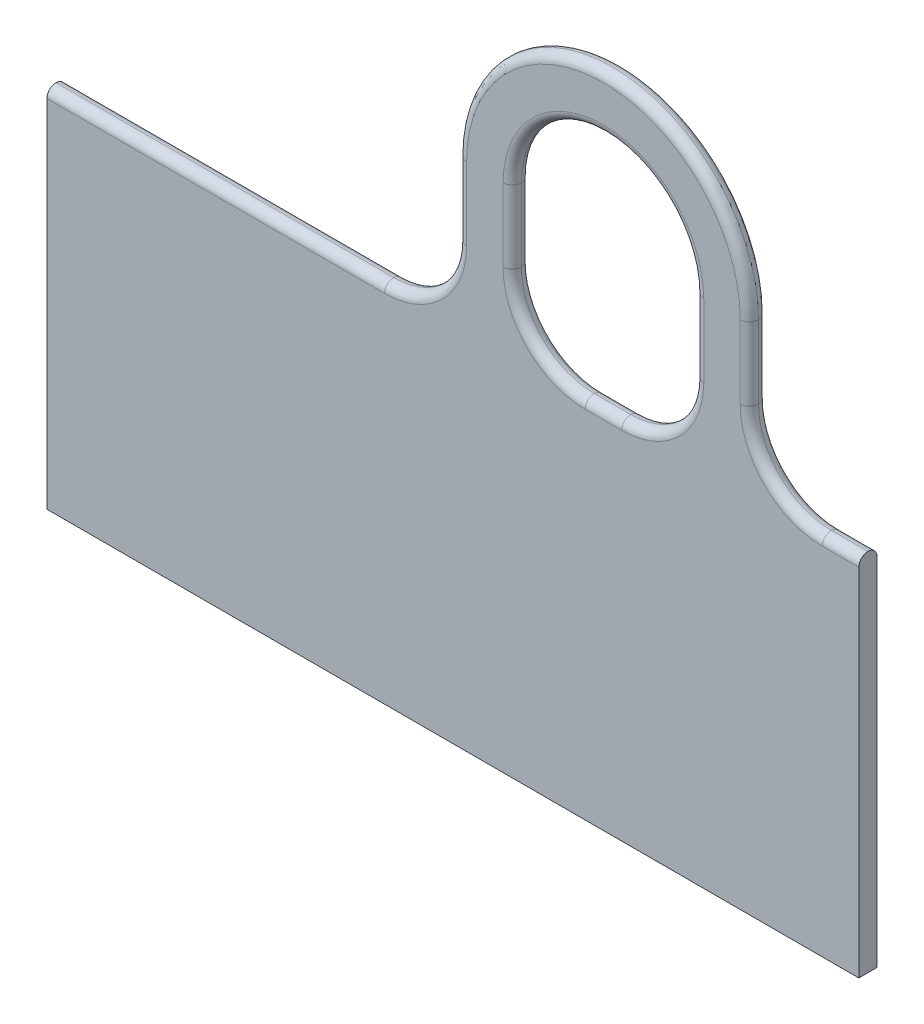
ISO-10303-21;
HEADER;
FILE_DESCRIPTION(('STEP AP214'),'2;1');
FILE_NAME('part.step','',(''),(''),'','','');
FILE_SCHEMA(('AUTOMOTIVE_DESIGN { 1 0 10303 214 1 1 1 1 }'));
ENDSEC;
DATA;
#1=APPLICATION_CONTEXT('core data for automotive mechanical design processes');
#2=APPLICATION_PROTOCOL_DEFINITION('international standard','automotive_design',2000,#1);
#3=PRODUCT_CONTEXT('',#1,'mechanical');
#4=PRODUCT('Part','Part','',(#3));
#5=PRODUCT_RELATED_PRODUCT_CATEGORY('part','',(#4));
#6=PRODUCT_DEFINITION_FORMATION('','',#4);
#7=PRODUCT_DEFINITION_CONTEXT('part definition',#1,'design');
#8=PRODUCT_DEFINITION('design','',#6,#7);
#9=PRODUCT_DEFINITION_SHAPE('','',#8);
#10=(LENGTH_UNIT() NAMED_UNIT(*) SI_UNIT(.MILLI.,.METRE.));
#11=(NAMED_UNIT(*) PLANE_ANGLE_UNIT() SI_UNIT($,.RADIAN.));
#12=(NAMED_UNIT(*) SI_UNIT($,.STERADIAN.) SOLID_ANGLE_UNIT());
#13=UNCERTAINTY_MEASURE_WITH_UNIT(LENGTH_MEASURE(1.E-05),#10,'distance_accuracy_value','');
#14=(GEOMETRIC_REPRESENTATION_CONTEXT(3) GLOBAL_UNCERTAINTY_ASSIGNED_CONTEXT((#13)) GLOBAL_UNIT_ASSIGNED_CONTEXT((#10,
#11,#12)) REPRESENTATION_CONTEXT('',''));
#15=CARTESIAN_POINT('',(0.,0.,0.));
#16=DIRECTION('',(0.,0.,1.));
#17=DIRECTION('',(1.,0.,0.));
#18=AXIS2_PLACEMENT_3D('',#15,#16,#17);
#19=CARTESIAN_POINT('',(-165.1,152.4,3.17499999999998));
#20=DIRECTION('',(0.,0.,-1.));
#21=DIRECTION('',(-1.,0.,0.));
#22=AXIS2_PLACEMENT_3D('',#19,#20,#21);
#23=PLANE('',#22);
#24=DIRECTION('',(0.,1.,0.));
#25=VECTOR('',#24,1.);
#26=CARTESIAN_POINT('',(2.22044604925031E-13,0.,3.17500000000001));
#27=LINE('',#26,#25);
#28=CARTESIAN_POINT('',(2.22044604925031E-13,0.,3.17500000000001));
#29=VERTEX_POINT('',#28);
#30=CARTESIAN_POINT('',(2.22044604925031E-13,123.825,3.17500000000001));
#31=VERTEX_POINT('',#30);
#32=EDGE_CURVE('E322',#29,#31,#27,.T.);
#33=ORIENTED_EDGE('',*,*,#32,.T.);
#34=DIRECTION('',(-1.,0.,0.));
#35=VECTOR('',#34,1.);
#36=CARTESIAN_POINT('',(-165.1,123.825,3.1749999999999));
#37=LINE('',#36,#35);
#38=CARTESIAN_POINT('',(-12.6999999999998,123.825,3.17500000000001));
#39=VERTEX_POINT('',#38);
#40=EDGE_CURVE('E11',#31,#39,#37,.T.);
#41=ORIENTED_EDGE('',*,*,#40,.T.);
#42=CARTESIAN_POINT('',(-12.6999999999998,152.4,3.1749999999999));
#43=DIRECTION('',(0.,0.,-1.));
#44=DIRECTION('',(-1.,0.,0.));
#45=AXIS2_PLACEMENT_3D('',#42,#43,#44);
#46=CIRCLE('',#45,28.575);
#47=CARTESIAN_POINT('',(-41.2749999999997,152.4,3.1749999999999));
#48=VERTEX_POINT('',#47);
#49=EDGE_CURVE('E47',#39,#48,#46,.T.);
#50=ORIENTED_EDGE('',*,*,#49,.T.);
#51=DIRECTION('',(0.,1.,0.));
#52=VECTOR('',#51,1.);
#53=CARTESIAN_POINT('',(-41.2749999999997,152.4,3.1749999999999));
#54=LINE('',#53,#52);
#55=CARTESIAN_POINT('',(-41.2749999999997,177.8,3.1749999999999));
#56=VERTEX_POINT('',#55);
#57=EDGE_CURVE('E381',#48,#56,#54,.T.);
#58=ORIENTED_EDGE('',*,*,#57,.T.);
#59=CARTESIAN_POINT('',(-88.8999999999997,177.8,3.1749999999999));
#60=DIRECTION('',(0.,0.,-1.));
#61=DIRECTION('',(-1.,0.,0.));
#62=AXIS2_PLACEMENT_3D('',#59,#60,#61);
#63=CIRCLE('',#62,47.625);
#64=CARTESIAN_POINT('',(-136.525,177.8,3.17499999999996));
#65=VERTEX_POINT('',#64);
#66=EDGE_CURVE('E379',#56,#65,#63,.F.);
#67=ORIENTED_EDGE('',*,*,#66,.T.);
#68=DIRECTION('',(0.,-1.,0.));
#69=VECTOR('',#68,1.);
#70=CARTESIAN_POINT('',(-136.525,152.4,3.17499999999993));
#71=LINE('',#70,#69);
#72=CARTESIAN_POINT('',(-136.525,152.4,3.17499999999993));
#73=VERTEX_POINT('',#72);
#74=EDGE_CURVE('E375',#65,#73,#71,.T.);
#75=ORIENTED_EDGE('',*,*,#74,.T.);
#76=CARTESIAN_POINT('',(-165.1,152.4,3.17499999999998));
#77=DIRECTION('',(0.,0.,-1.));
#78=DIRECTION('',(-1.,0.,0.));
#79=AXIS2_PLACEMENT_3D('',#76,#77,#78);
#80=CIRCLE('',#79,28.575);
#81=CARTESIAN_POINT('',(-165.1,123.825,3.1749999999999));
#82=VERTEX_POINT('',#81);
#83=EDGE_CURVE('E377',#73,#82,#80,.T.);
#84=ORIENTED_EDGE('',*,*,#83,.T.);
#85=DIRECTION('',(-1.,0.,0.));
#86=VECTOR('',#85,1.);
#87=CARTESIAN_POINT('',(-165.1,123.825,3.1749999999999));
#88=LINE('',#87,#86);
#89=CARTESIAN_POINT('',(-282.6004,123.825,3.17499999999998));
#90=VERTEX_POINT('',#89);
#91=EDGE_CURVE('E38',#82,#90,#88,.T.);
#92=ORIENTED_EDGE('',*,*,#91,.T.);
#93=DIRECTION('',(0.,-1.,0.));
#94=VECTOR('',#93,1.);
#95=CARTESIAN_POINT('',(-282.6004,0.,3.17499999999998));
#96=LINE('',#95,#94);
#97=CARTESIAN_POINT('',(-282.6004,0.,3.17499999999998));
#98=VERTEX_POINT('',#97);
#99=EDGE_CURVE('E318',#90,#98,#96,.T.);
#100=ORIENTED_EDGE('',*,*,#99,.T.);
#101=DIRECTION('',(1.,0.,0.));
#102=VECTOR('',#101,1.);
#103=CARTESIAN_POINT('',(-282.6004,0.,3.17499999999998));
#104=LINE('',#103,#102);
#105=EDGE_CURVE('E320',#98,#29,#104,.T.);
#106=ORIENTED_EDGE('',*,*,#105,.T.);
#107=EDGE_LOOP('',(#33,#41,#50,#58,#67,#75,#84,#92,#100,#106));
#108=FACE_BOUND('',#107,.T.);
#109=CARTESIAN_POINT('',(-82.5499999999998,152.4,3.1749999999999));
#110=DIRECTION('',(0.,0.,-1.));
#111=DIRECTION('',(-1.,0.,0.));
#112=AXIS2_PLACEMENT_3D('',#109,#110,#111);
#113=CIRCLE('',#112,28.575);
#114=CARTESIAN_POINT('',(-53.9749999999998,152.4,3.1749999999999));
#115=VERTEX_POINT('',#114);
#116=CARTESIAN_POINT('',(-82.5499999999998,123.825,3.1749999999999));
#117=VERTEX_POINT('',#116);
#118=EDGE_CURVE('E370',#115,#117,#113,.T.);
#119=ORIENTED_EDGE('',*,*,#118,.T.);
#120=DIRECTION('',(1.,0.,0.));
#121=VECTOR('',#120,1.);
#122=CARTESIAN_POINT('',(-95.2499999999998,123.825,3.1749999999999));
#123=LINE('',#122,#121);
#124=CARTESIAN_POINT('',(-95.2499999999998,123.825,3.1749999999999));
#125=VERTEX_POINT('',#124);
#126=EDGE_CURVE('E372',#117,#125,#123,.F.);
#127=ORIENTED_EDGE('',*,*,#126,.T.);
#128=CARTESIAN_POINT('',(-95.2499999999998,152.4,3.1749999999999));
#129=DIRECTION('',(0.,0.,-1.));
#130=DIRECTION('',(-1.,0.,0.));
#131=AXIS2_PLACEMENT_3D('',#128,#129,#130);
#132=CIRCLE('',#131,28.575);
#133=CARTESIAN_POINT('',(-123.825,152.4,3.1749999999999));
#134=VERTEX_POINT('',#133);
#135=EDGE_CURVE('E363',#125,#134,#132,.T.);
#136=ORIENTED_EDGE('',*,*,#135,.T.);
#137=DIRECTION('',(0.,-1.,0.));
#138=VECTOR('',#137,1.);
#139=CARTESIAN_POINT('',(-123.825,177.8,3.1749999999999));
#140=LINE('',#139,#138);
#141=CARTESIAN_POINT('',(-123.825,177.8,3.1749999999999));
#142=VERTEX_POINT('',#141);
#143=EDGE_CURVE('E189',#134,#142,#140,.F.);
#144=ORIENTED_EDGE('',*,*,#143,.T.);
#145=CARTESIAN_POINT('',(-88.8999999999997,177.8,3.1749999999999));
#146=DIRECTION('',(0.,0.,-1.));
#147=DIRECTION('',(-1.,0.,0.));
#148=AXIS2_PLACEMENT_3D('',#145,#146,#147);
#149=CIRCLE('',#148,34.925);
#150=CARTESIAN_POINT('',(-53.9749999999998,177.8,3.1749999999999));
#151=VERTEX_POINT('',#150);
#152=EDGE_CURVE('E366',#142,#151,#149,.T.);
#153=ORIENTED_EDGE('',*,*,#152,.T.);
#154=DIRECTION('',(0.,1.,0.));
#155=VECTOR('',#154,1.);
#156=CARTESIAN_POINT('',(-53.9749999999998,152.4,3.1749999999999));
#157=LINE('',#156,#155);
#158=EDGE_CURVE('E368',#151,#115,#157,.F.);
#159=ORIENTED_EDGE('',*,*,#158,.T.);
#160=EDGE_LOOP('',(#119,#127,#136,#144,#153,#159));
#161=FACE_BOUND('',#160,.T.);
#162=ADVANCED_FACE('F30',(#108,#161),#23,.F.);
#163=CARTESIAN_POINT('',(-282.6004,0.,3.17499999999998));
#164=DIRECTION('',(1.,0.,0.));
#165=DIRECTION('',(0.,0.,-1.));
#166=AXIS2_PLACEMENT_3D('',#163,#164,#165);
#167=PLANE('',#166);
#168=CARTESIAN_POINT('',(-282.6004,123.825,0.));
#169=DIRECTION('',(1.,0.,0.));
#170=DIRECTION('',(0.,0.,-1.));
#171=AXIS2_PLACEMENT_3D('',#168,#169,#170);
#172=CIRCLE('',#171,3.175);
#173=CARTESIAN_POINT('',(-282.6004,127.,0.));
#174=VERTEX_POINT('',#173);
#175=EDGE_CURVE('E359',#90,#174,#172,.F.);
#176=ORIENTED_EDGE('',*,*,#175,.T.);
#177=CARTESIAN_POINT('',(-282.6004,123.825,0.));
#178=DIRECTION('',(1.,0.,0.));
#179=DIRECTION('',(0.,0.,-1.));
#180=AXIS2_PLACEMENT_3D('',#177,#178,#179);
#181=CIRCLE('',#180,3.175);
#182=CARTESIAN_POINT('',(-282.6004,123.825,-3.17500000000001));
#183=VERTEX_POINT('',#182);
#184=EDGE_CURVE('E361',#174,#183,#181,.F.);
#185=ORIENTED_EDGE('',*,*,#184,.T.);
#186=DIRECTION('',(0.,-1.,0.));
#187=VECTOR('',#186,1.);
#188=CARTESIAN_POINT('',(-282.6004,0.,-3.17500000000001));
#189=LINE('',#188,#187);
#190=CARTESIAN_POINT('',(-282.6004,0.,-3.17500000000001));
#191=VERTEX_POINT('',#190);
#192=EDGE_CURVE('E310',#183,#191,#189,.T.);
#193=ORIENTED_EDGE('',*,*,#192,.T.);
#194=DIRECTION('',(0.,0.,-1.));
#195=VECTOR('',#194,1.);
#196=CARTESIAN_POINT('',(-282.6004,0.,3.17499999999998));
#197=LINE('',#196,#195);
#198=EDGE_CURVE('E326',#98,#191,#197,.T.);
#199=ORIENTED_EDGE('',*,*,#198,.F.);
#200=ORIENTED_EDGE('',*,*,#99,.F.);
#201=EDGE_LOOP('',(#176,#185,#193,#199,#200));
#202=FACE_BOUND('',#201,.T.);
#203=ADVANCED_FACE('F32',(#202),#167,.F.);
#204=CARTESIAN_POINT('',(-282.6004,0.,3.17499999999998));
#205=DIRECTION('',(0.,1.,0.));
#206=DIRECTION('',(0.,0.,1.));
#207=AXIS2_PLACEMENT_3D('',#204,#205,#206);
#208=PLANE('',#207);
#209=ORIENTED_EDGE('',*,*,#198,.T.);
#210=DIRECTION('',(1.,0.,0.));
#211=VECTOR('',#210,1.);
#212=CARTESIAN_POINT('',(-282.6004,0.,-3.17500000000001));
#213=LINE('',#212,#211);
#214=CARTESIAN_POINT('',(2.22044604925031E-13,0.,-3.17500000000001));
#215=VERTEX_POINT('',#214);
#216=EDGE_CURVE('E312',#191,#215,#213,.T.);
#217=ORIENTED_EDGE('',*,*,#216,.T.);
#218=DIRECTION('',(0.,0.,-1.));
#219=VECTOR('',#218,1.);
#220=CARTESIAN_POINT('',(2.22044604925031E-13,0.,3.17500000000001));
#221=LINE('',#220,#219);
#222=EDGE_CURVE('E324',#29,#215,#221,.T.);
#223=ORIENTED_EDGE('',*,*,#222,.F.);
#224=ORIENTED_EDGE('',*,*,#105,.F.);
#225=EDGE_LOOP('',(#209,#217,#223,#224));
#226=FACE_BOUND('',#225,.T.);
#227=ADVANCED_FACE('F407',(#226),#208,.F.);
#228=CARTESIAN_POINT('',(2.22044604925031E-13,0.,3.17500000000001));
#229=DIRECTION('',(-1.,0.,0.));
#230=DIRECTION('',(0.,0.,1.));
#231=AXIS2_PLACEMENT_3D('',#228,#229,#230);
#232=PLANE('',#231);
#233=DIRECTION('',(0.,1.,0.));
#234=VECTOR('',#233,1.);
#235=CARTESIAN_POINT('',(2.22044604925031E-13,0.,-3.17500000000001));
#236=LINE('',#235,#234);
#237=CARTESIAN_POINT('',(2.22044604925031E-13,123.825,-3.17500000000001));
#238=VERTEX_POINT('',#237);
#239=EDGE_CURVE('E315',#215,#238,#236,.T.);
#240=ORIENTED_EDGE('',*,*,#239,.T.);
#241=CARTESIAN_POINT('',(2.22044604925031E-13,123.825,0.));
#242=DIRECTION('',(-1.,0.,0.));
#243=DIRECTION('',(0.,0.,1.));
#244=AXIS2_PLACEMENT_3D('',#241,#242,#243);
#245=CIRCLE('',#244,3.175);
#246=CARTESIAN_POINT('',(2.22044604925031E-13,127.,0.));
#247=VERTEX_POINT('',#246);
#248=EDGE_CURVE('E357',#238,#247,#245,.F.);
#249=ORIENTED_EDGE('',*,*,#248,.T.);
#250=CARTESIAN_POINT('',(2.22044604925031E-13,123.825,0.));
#251=DIRECTION('',(-1.,0.,0.));
#252=DIRECTION('',(0.,0.,1.));
#253=AXIS2_PLACEMENT_3D('',#250,#251,#252);
#254=CIRCLE('',#253,3.175);
#255=EDGE_CURVE('E355',#247,#31,#254,.F.);
#256=ORIENTED_EDGE('',*,*,#255,.T.);
#257=ORIENTED_EDGE('',*,*,#32,.F.);
#258=ORIENTED_EDGE('',*,*,#222,.T.);
#259=EDGE_LOOP('',(#240,#249,#256,#257,#258));
#260=FACE_BOUND('',#259,.T.);
#261=ADVANCED_FACE('F463',(#260),#232,.F.);
#262=CARTESIAN_POINT('',(-165.1,152.4,-3.17500000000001));
#263=DIRECTION('',(0.,0.,-1.));
#264=DIRECTION('',(-1.,0.,0.));
#265=AXIS2_PLACEMENT_3D('',#262,#263,#264);
#266=PLANE('',#265);
#267=DIRECTION('',(0.,-1.,0.));
#268=VECTOR('',#267,1.);
#269=CARTESIAN_POINT('',(-123.825,152.4,-3.17500000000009));
#270=LINE('',#269,#268);
#271=CARTESIAN_POINT('',(-123.825,177.8,-3.17500000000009));
#272=VERTEX_POINT('',#271);
#273=CARTESIAN_POINT('',(-123.825,152.4,-3.17500000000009));
#274=VERTEX_POINT('',#273);
#275=EDGE_CURVE('E344',#272,#274,#270,.T.);
#276=ORIENTED_EDGE('',*,*,#275,.T.);
#277=CARTESIAN_POINT('',(-95.2499999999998,152.4,-3.17500000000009));
#278=DIRECTION('',(0.,0.,-1.));
#279=DIRECTION('',(-1.,0.,0.));
#280=AXIS2_PLACEMENT_3D('',#277,#278,#279);
#281=CIRCLE('',#280,28.575);
#282=CARTESIAN_POINT('',(-95.2499999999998,123.825,-3.17500000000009));
#283=VERTEX_POINT('',#282);
#284=EDGE_CURVE('E215',#274,#283,#281,.F.);
#285=ORIENTED_EDGE('',*,*,#284,.T.);
#286=DIRECTION('',(1.,0.,0.));
#287=VECTOR('',#286,1.);
#288=CARTESIAN_POINT('',(-165.1,123.825,-3.17500000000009));
#289=LINE('',#288,#287);
#290=CARTESIAN_POINT('',(-82.5499999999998,123.825,-3.17500000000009));
#291=VERTEX_POINT('',#290);
#292=EDGE_CURVE('E352',#283,#291,#289,.T.);
#293=ORIENTED_EDGE('',*,*,#292,.T.);
#294=CARTESIAN_POINT('',(-82.5499999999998,152.4,-3.17500000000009));
#295=DIRECTION('',(0.,0.,-1.));
#296=DIRECTION('',(-1.,0.,0.));
#297=AXIS2_PLACEMENT_3D('',#294,#295,#296);
#298=CIRCLE('',#297,28.575);
#299=CARTESIAN_POINT('',(-53.9749999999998,152.4,-3.17500000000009));
#300=VERTEX_POINT('',#299);
#301=EDGE_CURVE('E350',#291,#300,#298,.F.);
#302=ORIENTED_EDGE('',*,*,#301,.T.);
#303=DIRECTION('',(0.,1.,0.));
#304=VECTOR('',#303,1.);
#305=CARTESIAN_POINT('',(-53.9749999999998,152.4,-3.17500000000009));
#306=LINE('',#305,#304);
#307=CARTESIAN_POINT('',(-53.9749999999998,177.8,-3.17500000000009));
#308=VERTEX_POINT('',#307);
#309=EDGE_CURVE('E348',#300,#308,#306,.T.);
#310=ORIENTED_EDGE('',*,*,#309,.T.);
#311=CARTESIAN_POINT('',(-88.8999999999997,177.8,-3.17500000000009));
#312=DIRECTION('',(0.,0.,-1.));
#313=DIRECTION('',(-1.,0.,0.));
#314=AXIS2_PLACEMENT_3D('',#311,#312,#313);
#315=CIRCLE('',#314,34.925);
#316=EDGE_CURVE('E346',#308,#272,#315,.F.);
#317=ORIENTED_EDGE('',*,*,#316,.T.);
#318=EDGE_LOOP('',(#276,#285,#293,#302,#310,#317));
#319=FACE_BOUND('',#318,.T.);
#320=CARTESIAN_POINT('',(-12.6999999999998,152.4,-3.17500000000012));
#321=DIRECTION('',(0.,0.,-1.));
#322=DIRECTION('',(-1.,0.,0.));
#323=AXIS2_PLACEMENT_3D('',#320,#321,#322);
#324=CIRCLE('',#323,28.575);
#325=CARTESIAN_POINT('',(-41.2749999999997,152.4,-3.17500000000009));
#326=VERTEX_POINT('',#325);
#327=CARTESIAN_POINT('',(-12.6999999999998,123.825,-3.17500000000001));
#328=VERTEX_POINT('',#327);
#329=EDGE_CURVE('E329',#326,#328,#324,.F.);
#330=ORIENTED_EDGE('',*,*,#329,.T.);
#331=DIRECTION('',(-1.,0.,0.));
#332=VECTOR('',#331,1.);
#333=CARTESIAN_POINT('',(2.22044604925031E-13,123.825,-3.17500000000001));
#334=LINE('',#333,#332);
#335=EDGE_CURVE('E341',#328,#238,#334,.F.);
#336=ORIENTED_EDGE('',*,*,#335,.T.);
#337=ORIENTED_EDGE('',*,*,#239,.F.);
#338=ORIENTED_EDGE('',*,*,#216,.F.);
#339=ORIENTED_EDGE('',*,*,#192,.F.);
#340=DIRECTION('',(-1.,0.,0.));
#341=VECTOR('',#340,1.);
#342=CARTESIAN_POINT('',(-165.1,123.825,-3.17500000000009));
#343=LINE('',#342,#341);
#344=CARTESIAN_POINT('',(-165.1,123.825,-3.17500000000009));
#345=VERTEX_POINT('',#344);
#346=EDGE_CURVE('E339',#183,#345,#343,.F.);
#347=ORIENTED_EDGE('',*,*,#346,.T.);
#348=CARTESIAN_POINT('',(-165.1,152.4,-3.17500000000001));
#349=DIRECTION('',(0.,0.,-1.));
#350=DIRECTION('',(-1.,0.,0.));
#351=AXIS2_PLACEMENT_3D('',#348,#349,#350);
#352=CIRCLE('',#351,28.575);
#353=CARTESIAN_POINT('',(-136.525,152.4,-3.17500000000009));
#354=VERTEX_POINT('',#353);
#355=EDGE_CURVE('E337',#345,#354,#352,.F.);
#356=ORIENTED_EDGE('',*,*,#355,.T.);
#357=DIRECTION('',(0.,-1.,0.));
#358=VECTOR('',#357,1.);
#359=CARTESIAN_POINT('',(-136.525,177.8,-3.17500000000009));
#360=LINE('',#359,#358);
#361=CARTESIAN_POINT('',(-136.525,177.8,-3.17500000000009));
#362=VERTEX_POINT('',#361);
#363=EDGE_CURVE('E335',#354,#362,#360,.F.);
#364=ORIENTED_EDGE('',*,*,#363,.T.);
#365=CARTESIAN_POINT('',(-88.8999999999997,177.8,-3.17500000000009));
#366=DIRECTION('',(0.,0.,-1.));
#367=DIRECTION('',(-1.,0.,0.));
#368=AXIS2_PLACEMENT_3D('',#365,#366,#367);
#369=CIRCLE('',#368,47.625);
#370=CARTESIAN_POINT('',(-41.2749999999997,177.8,-3.17500000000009));
#371=VERTEX_POINT('',#370);
#372=EDGE_CURVE('E333',#362,#371,#369,.T.);
#373=ORIENTED_EDGE('',*,*,#372,.T.);
#374=DIRECTION('',(0.,1.,0.));
#375=VECTOR('',#374,1.);
#376=CARTESIAN_POINT('',(-41.2749999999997,152.4,-3.17500000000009));
#377=LINE('',#376,#375);
#378=EDGE_CURVE('E331',#371,#326,#377,.F.);
#379=ORIENTED_EDGE('',*,*,#378,.T.);
#380=EDGE_LOOP('',(#330,#336,#337,#338,#339,#347,#356,#364,#373,#379));
#381=FACE_BOUND('',#380,.T.);
#382=ADVANCED_FACE('F403',(#319,#381),#266,.T.);
#383=CARTESIAN_POINT('',(-165.1,123.825,-1.11022302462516E-13));
#384=DIRECTION('',(-1.,0.,0.));
#385=DIRECTION('',(0.,0.,1.));
#386=AXIS2_PLACEMENT_3D('',#383,#384,#385);
#387=CYLINDRICAL_SURFACE('',#386,3.175);
#388=ORIENTED_EDGE('',*,*,#175,.F.);
#389=ORIENTED_EDGE('',*,*,#91,.F.);
#390=CARTESIAN_POINT('',(-165.1,123.825,-1.11022302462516E-13));
#391=DIRECTION('',(1.,0.,0.));
#392=DIRECTION('',(0.,0.,-1.));
#393=AXIS2_PLACEMENT_3D('',#390,#391,#392);
#394=CIRCLE('',#393,3.175);
#395=CARTESIAN_POINT('',(-165.1,127.,0.));
#396=VERTEX_POINT('',#395);
#397=EDGE_CURVE('E307',#396,#82,#394,.T.);
#398=ORIENTED_EDGE('',*,*,#397,.F.);
#399=DIRECTION('',(-1.,0.,0.));
#400=VECTOR('',#399,1.);
#401=CARTESIAN_POINT('',(-282.6004,127.,0.));
#402=LINE('',#401,#400);
#403=EDGE_CURVE('E304',#174,#396,#402,.F.);
#404=ORIENTED_EDGE('',*,*,#403,.F.);
#405=EDGE_LOOP('',(#388,#389,#398,#404));
#406=FACE_BOUND('',#405,.T.);
#407=ADVANCED_FACE('F393',(#406),#387,.T.);
#408=CARTESIAN_POINT('',(-165.1,152.4,0.));
#409=DIRECTION('',(0.,0.,-1.));
#410=DIRECTION('',(-1.,0.,0.));
#411=AXIS2_PLACEMENT_3D('',#408,#409,#410);
#412=TOROIDAL_SURFACE('',#411,28.575,3.175);
#413=ORIENTED_EDGE('',*,*,#397,.T.);
#414=ORIENTED_EDGE('',*,*,#83,.F.);
#415=CARTESIAN_POINT('',(-136.525,152.4,-1.11022302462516E-13));
#416=DIRECTION('',(0.,1.,0.));
#417=DIRECTION('',(0.,0.,1.));
#418=AXIS2_PLACEMENT_3D('',#415,#416,#417);
#419=CIRCLE('',#418,3.175);
#420=CARTESIAN_POINT('',(-139.7,152.4,-1.11022302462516E-13));
#421=VERTEX_POINT('',#420);
#422=EDGE_CURVE('E301',#421,#73,#419,.T.);
#423=ORIENTED_EDGE('',*,*,#422,.F.);
#424=CARTESIAN_POINT('',(-165.1,152.4,0.));
#425=DIRECTION('',(0.,0.,-1.));
#426=DIRECTION('',(-1.,0.,0.));
#427=AXIS2_PLACEMENT_3D('',#424,#425,#426);
#428=CIRCLE('',#427,25.4);
#429=EDGE_CURVE('E298',#396,#421,#428,.F.);
#430=ORIENTED_EDGE('',*,*,#429,.F.);
#431=EDGE_LOOP('',(#413,#414,#423,#430));
#432=FACE_BOUND('',#431,.T.);
#433=ADVANCED_FACE('F447',(#432),#412,.T.);
#434=CARTESIAN_POINT('',(-282.6004,123.825,0.));
#435=DIRECTION('',(1.,0.,0.));
#436=DIRECTION('',(0.,0.,-1.));
#437=AXIS2_PLACEMENT_3D('',#434,#435,#436);
#438=CYLINDRICAL_SURFACE('',#437,3.175);
#439=ORIENTED_EDGE('',*,*,#184,.F.);
#440=ORIENTED_EDGE('',*,*,#403,.T.);
#441=CARTESIAN_POINT('',(-165.1,123.825,-1.11022302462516E-13));
#442=DIRECTION('',(1.,0.,0.));
#443=DIRECTION('',(0.,0.,-1.));
#444=AXIS2_PLACEMENT_3D('',#441,#442,#443);
#445=CIRCLE('',#444,3.175);
#446=EDGE_CURVE('E295',#345,#396,#445,.T.);
#447=ORIENTED_EDGE('',*,*,#446,.F.);
#448=ORIENTED_EDGE('',*,*,#346,.F.);
#449=EDGE_LOOP('',(#439,#440,#447,#448));
#450=FACE_BOUND('',#449,.T.);
#451=ADVANCED_FACE('F399',(#450),#438,.T.);
#452=CARTESIAN_POINT('',(-136.525,152.4,-1.11022302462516E-13));
#453=DIRECTION('',(0.,-1.,0.));
#454=DIRECTION('',(0.,0.,-1.));
#455=AXIS2_PLACEMENT_3D('',#452,#453,#454);
#456=CYLINDRICAL_SURFACE('',#455,3.175);
#457=ORIENTED_EDGE('',*,*,#422,.T.);
#458=ORIENTED_EDGE('',*,*,#74,.F.);
#459=CARTESIAN_POINT('',(-136.525,177.8,-1.11022302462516E-13));
#460=DIRECTION('',(0.,1.,0.));
#461=DIRECTION('',(0.,0.,1.));
#462=AXIS2_PLACEMENT_3D('',#459,#460,#461);
#463=CIRCLE('',#462,3.175);
#464=CARTESIAN_POINT('',(-139.7,177.8,-1.11022302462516E-13));
#465=VERTEX_POINT('',#464);
#466=EDGE_CURVE('E292',#465,#65,#463,.T.);
#467=ORIENTED_EDGE('',*,*,#466,.F.);
#468=DIRECTION('',(0.,-1.,0.));
#469=VECTOR('',#468,1.);
#470=CARTESIAN_POINT('',(-139.7,177.8,-1.11022302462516E-13));
#471=LINE('',#470,#469);
#472=EDGE_CURVE('E289',#421,#465,#471,.F.);
#473=ORIENTED_EDGE('',*,*,#472,.F.);
#474=EDGE_LOOP('',(#457,#458,#467,#473));
#475=FACE_BOUND('',#474,.T.);
#476=ADVANCED_FACE('F436',(#475),#456,.T.);
#477=CARTESIAN_POINT('',(-165.1,152.4,0.));
#478=DIRECTION('',(0.,0.,-1.));
#479=DIRECTION('',(-1.,0.,0.));
#480=AXIS2_PLACEMENT_3D('',#477,#478,#479);
#481=TOROIDAL_SURFACE('',#480,28.575,3.175);
#482=ORIENTED_EDGE('',*,*,#446,.T.);
#483=ORIENTED_EDGE('',*,*,#429,.T.);
#484=CARTESIAN_POINT('',(-136.525,152.4,-1.11022302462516E-13));
#485=DIRECTION('',(0.,1.,0.));
#486=DIRECTION('',(0.,0.,1.));
#487=AXIS2_PLACEMENT_3D('',#484,#485,#486);
#488=CIRCLE('',#487,3.175);
#489=EDGE_CURVE('E286',#354,#421,#488,.T.);
#490=ORIENTED_EDGE('',*,*,#489,.F.);
#491=ORIENTED_EDGE('',*,*,#355,.F.);
#492=EDGE_LOOP('',(#482,#483,#490,#491));
#493=FACE_BOUND('',#492,.T.);
#494=ADVANCED_FACE('F445',(#493),#481,.T.);
#495=CARTESIAN_POINT('',(-88.8999999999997,177.8,-1.11022302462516E-13));
#496=DIRECTION('',(0.,0.,-1.));
#497=DIRECTION('',(-1.,0.,0.));
#498=AXIS2_PLACEMENT_3D('',#495,#496,#497);
#499=TOROIDAL_SURFACE('',#498,47.625,3.175);
#500=ORIENTED_EDGE('',*,*,#466,.T.);
#501=ORIENTED_EDGE('',*,*,#66,.F.);
#502=CARTESIAN_POINT('',(-41.2749999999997,177.8,-1.11022302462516E-13));
#503=DIRECTION('',(0.,-1.,0.));
#504=DIRECTION('',(0.,0.,-1.));
#505=AXIS2_PLACEMENT_3D('',#502,#503,#504);
#506=CIRCLE('',#505,3.175);
#507=CARTESIAN_POINT('',(-38.0999999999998,177.8,-1.11022302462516E-13));
#508=VERTEX_POINT('',#507);
#509=EDGE_CURVE('E283',#508,#56,#506,.T.);
#510=ORIENTED_EDGE('',*,*,#509,.F.);
#511=CARTESIAN_POINT('',(-88.8999999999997,177.8,-1.11022302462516E-13));
#512=DIRECTION('',(0.,0.,-1.));
#513=DIRECTION('',(-1.,0.,0.));
#514=AXIS2_PLACEMENT_3D('',#511,#512,#513);
#515=CIRCLE('',#514,50.8);
#516=EDGE_CURVE('E280',#465,#508,#515,.T.);
#517=ORIENTED_EDGE('',*,*,#516,.F.);
#518=EDGE_LOOP('',(#500,#501,#510,#517));
#519=FACE_BOUND('',#518,.T.);
#520=ADVANCED_FACE('F432',(#519),#499,.T.);
#521=CARTESIAN_POINT('',(-136.525,177.8,-1.11022302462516E-13));
#522=DIRECTION('',(0.,1.,0.));
#523=DIRECTION('',(0.,0.,1.));
#524=AXIS2_PLACEMENT_3D('',#521,#522,#523);
#525=CYLINDRICAL_SURFACE('',#524,3.175);
#526=ORIENTED_EDGE('',*,*,#489,.T.);
#527=ORIENTED_EDGE('',*,*,#472,.T.);
#528=CARTESIAN_POINT('',(-136.525,177.8,-1.11022302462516E-13));
#529=DIRECTION('',(0.,1.,0.));
#530=DIRECTION('',(0.,0.,1.));
#531=AXIS2_PLACEMENT_3D('',#528,#529,#530);
#532=CIRCLE('',#531,3.175);
#533=EDGE_CURVE('E277',#362,#465,#532,.T.);
#534=ORIENTED_EDGE('',*,*,#533,.F.);
#535=ORIENTED_EDGE('',*,*,#363,.F.);
#536=EDGE_LOOP('',(#526,#527,#534,#535));
#537=FACE_BOUND('',#536,.T.);
#538=ADVANCED_FACE('F439',(#537),#525,.T.);
#539=CARTESIAN_POINT('',(-41.2749999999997,152.4,-1.11022302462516E-13));
#540=DIRECTION('',(0.,1.,0.));
#541=DIRECTION('',(0.,0.,1.));
#542=AXIS2_PLACEMENT_3D('',#539,#540,#541);
#543=CYLINDRICAL_SURFACE('',#542,3.175);
#544=ORIENTED_EDGE('',*,*,#509,.T.);
#545=ORIENTED_EDGE('',*,*,#57,.F.);
#546=CARTESIAN_POINT('',(-41.2749999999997,152.4,-1.11022302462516E-13));
#547=DIRECTION('',(0.,-1.,0.));
#548=DIRECTION('',(0.,0.,-1.));
#549=AXIS2_PLACEMENT_3D('',#546,#547,#548);
#550=CIRCLE('',#549,3.175);
#551=CARTESIAN_POINT('',(-38.0999999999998,152.4,-1.11022302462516E-13));
#552=VERTEX_POINT('',#551);
#553=EDGE_CURVE('E274',#552,#48,#550,.T.);
#554=ORIENTED_EDGE('',*,*,#553,.F.);
#555=DIRECTION('',(0.,1.,0.));
#556=VECTOR('',#555,1.);
#557=CARTESIAN_POINT('',(-38.0999999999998,177.8,-1.11022302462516E-13));
#558=LINE('',#557,#556);
#559=EDGE_CURVE('E271',#508,#552,#558,.F.);
#560=ORIENTED_EDGE('',*,*,#559,.F.);
#561=EDGE_LOOP('',(#544,#545,#554,#560));
#562=FACE_BOUND('',#561,.T.);
#563=ADVANCED_FACE('F428',(#562),#543,.T.);
#564=CARTESIAN_POINT('',(-88.8999999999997,177.8,-1.11022302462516E-13));
#565=DIRECTION('',(0.,0.,-1.));
#566=DIRECTION('',(-1.,0.,0.));
#567=AXIS2_PLACEMENT_3D('',#564,#565,#566);
#568=TOROIDAL_SURFACE('',#567,47.625,3.175);
#569=ORIENTED_EDGE('',*,*,#533,.T.);
#570=ORIENTED_EDGE('',*,*,#516,.T.);
#571=CARTESIAN_POINT('',(-41.2749999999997,177.8,-1.11022302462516E-13));
#572=DIRECTION('',(0.,-1.,0.));
#573=DIRECTION('',(0.,0.,-1.));
#574=AXIS2_PLACEMENT_3D('',#571,#572,#573);
#575=CIRCLE('',#574,3.175);
#576=EDGE_CURVE('E268',#371,#508,#575,.T.);
#577=ORIENTED_EDGE('',*,*,#576,.F.);
#578=ORIENTED_EDGE('',*,*,#372,.F.);
#579=EDGE_LOOP('',(#569,#570,#577,#578));
#580=FACE_BOUND('',#579,.T.);
#581=ADVANCED_FACE('F535',(#580),#568,.T.);
#582=CARTESIAN_POINT('',(-12.6999999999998,152.4,-1.11022302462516E-13));
#583=DIRECTION('',(0.,0.,-1.));
#584=DIRECTION('',(-1.,0.,0.));
#585=AXIS2_PLACEMENT_3D('',#582,#583,#584);
#586=TOROIDAL_SURFACE('',#585,28.575,3.175);
#587=ORIENTED_EDGE('',*,*,#553,.T.);
#588=ORIENTED_EDGE('',*,*,#49,.F.);
#589=CARTESIAN_POINT('',(-12.6999999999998,123.825,0.));
#590=DIRECTION('',(1.,0.,0.));
#591=DIRECTION('',(0.,0.,-1.));
#592=AXIS2_PLACEMENT_3D('',#589,#590,#591);
#593=CIRCLE('',#592,3.175);
#594=CARTESIAN_POINT('',(-12.6999999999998,127.,-1.11022302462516E-13));
#595=VERTEX_POINT('',#594);
#596=EDGE_CURVE('E265',#595,#39,#593,.T.);
#597=ORIENTED_EDGE('',*,*,#596,.F.);
#598=CARTESIAN_POINT('',(-12.6999999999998,152.4,-1.11022302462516E-13));
#599=DIRECTION('',(0.,0.,-1.));
#600=DIRECTION('',(-1.,0.,0.));
#601=AXIS2_PLACEMENT_3D('',#598,#599,#600);
#602=CIRCLE('',#601,25.4);
#603=EDGE_CURVE('E262',#552,#595,#602,.F.);
#604=ORIENTED_EDGE('',*,*,#603,.F.);
#605=EDGE_LOOP('',(#587,#588,#597,#604));
#606=FACE_BOUND('',#605,.T.);
#607=ADVANCED_FACE('F416',(#606),#586,.T.);
#608=CARTESIAN_POINT('',(-41.2749999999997,177.8,-1.11022302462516E-13));
#609=DIRECTION('',(0.,-1.,0.));
#610=DIRECTION('',(0.,0.,-1.));
#611=AXIS2_PLACEMENT_3D('',#608,#609,#610);
#612=CYLINDRICAL_SURFACE('',#611,3.175);
#613=ORIENTED_EDGE('',*,*,#576,.T.);
#614=ORIENTED_EDGE('',*,*,#559,.T.);
#615=CARTESIAN_POINT('',(-41.2749999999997,152.4,-1.11022302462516E-13));
#616=DIRECTION('',(0.,-1.,0.));
#617=DIRECTION('',(0.,0.,-1.));
#618=AXIS2_PLACEMENT_3D('',#615,#616,#617);
#619=CIRCLE('',#618,3.175);
#620=EDGE_CURVE('E259',#326,#552,#619,.T.);
#621=ORIENTED_EDGE('',*,*,#620,.F.);
#622=ORIENTED_EDGE('',*,*,#378,.F.);
#623=EDGE_LOOP('',(#613,#614,#621,#622));
#624=FACE_BOUND('',#623,.T.);
#625=ADVANCED_FACE('F424',(#624),#612,.T.);
#626=CARTESIAN_POINT('',(-165.1,123.825,-1.11022302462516E-13));
#627=DIRECTION('',(-1.,0.,0.));
#628=DIRECTION('',(0.,0.,1.));
#629=AXIS2_PLACEMENT_3D('',#626,#627,#628);
#630=CYLINDRICAL_SURFACE('',#629,3.175);
#631=ORIENTED_EDGE('',*,*,#40,.F.);
#632=ORIENTED_EDGE('',*,*,#255,.F.);
#633=DIRECTION('',(-1.,0.,0.));
#634=VECTOR('',#633,1.);
#635=CARTESIAN_POINT('',(-12.6999999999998,127.,-1.11022302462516E-13));
#636=LINE('',#635,#634);
#637=EDGE_CURVE('E256',#595,#247,#636,.F.);
#638=ORIENTED_EDGE('',*,*,#637,.F.);
#639=ORIENTED_EDGE('',*,*,#596,.T.);
#640=EDGE_LOOP('',(#631,#632,#638,#639));
#641=FACE_BOUND('',#640,.T.);
#642=ADVANCED_FACE('F412',(#641),#630,.T.);
#643=CARTESIAN_POINT('',(-12.6999999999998,152.4,-1.11022302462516E-13));
#644=DIRECTION('',(0.,0.,-1.));
#645=DIRECTION('',(-1.,0.,0.));
#646=AXIS2_PLACEMENT_3D('',#643,#644,#645);
#647=TOROIDAL_SURFACE('',#646,28.575,3.175);
#648=ORIENTED_EDGE('',*,*,#620,.T.);
#649=ORIENTED_EDGE('',*,*,#603,.T.);
#650=CARTESIAN_POINT('',(-12.6999999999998,123.825,0.));
#651=DIRECTION('',(1.,0.,0.));
#652=DIRECTION('',(0.,0.,-1.));
#653=AXIS2_PLACEMENT_3D('',#650,#651,#652);
#654=CIRCLE('',#653,3.175);
#655=EDGE_CURVE('E253',#328,#595,#654,.T.);
#656=ORIENTED_EDGE('',*,*,#655,.F.);
#657=ORIENTED_EDGE('',*,*,#329,.F.);
#658=EDGE_LOOP('',(#648,#649,#656,#657));
#659=FACE_BOUND('',#658,.T.);
#660=ADVANCED_FACE('F419',(#659),#647,.T.);
#661=CARTESIAN_POINT('',(-12.6999999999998,123.825,0.));
#662=DIRECTION('',(1.,0.,0.));
#663=DIRECTION('',(0.,0.,-1.));
#664=AXIS2_PLACEMENT_3D('',#661,#662,#663);
#665=CYLINDRICAL_SURFACE('',#664,3.175);
#666=ORIENTED_EDGE('',*,*,#248,.F.);
#667=ORIENTED_EDGE('',*,*,#335,.F.);
#668=ORIENTED_EDGE('',*,*,#655,.T.);
#669=ORIENTED_EDGE('',*,*,#637,.T.);
#670=EDGE_LOOP('',(#666,#667,#668,#669));
#671=FACE_BOUND('',#670,.T.);
#672=ADVANCED_FACE('F577',(#671),#665,.T.);
#673=CARTESIAN_POINT('',(-53.9749999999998,177.8,-1.11022302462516E-13));
#674=DIRECTION('',(0.,-1.,0.));
#675=DIRECTION('',(1.,0.,0.));
#676=AXIS2_PLACEMENT_3D('',#673,#674,#675);
#677=CYLINDRICAL_SURFACE('',#676,3.175);
#678=CARTESIAN_POINT('',(-53.9749999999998,152.4,-1.11022302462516E-13));
#679=DIRECTION('',(0.,-1.,0.));
#680=DIRECTION('',(0.,0.,-1.));
#681=AXIS2_PLACEMENT_3D('',#678,#679,#680);
#682=CIRCLE('',#681,3.175);
#683=CARTESIAN_POINT('',(-57.1499999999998,152.4,-1.11022302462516E-13));
#684=VERTEX_POINT('',#683);
#685=EDGE_CURVE('E244',#115,#684,#682,.T.);
#686=ORIENTED_EDGE('',*,*,#685,.F.);
#687=ORIENTED_EDGE('',*,*,#158,.F.);
#688=CARTESIAN_POINT('',(-53.9749999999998,177.8,-1.11022302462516E-13));
#689=DIRECTION('',(0.,1.,0.));
#690=DIRECTION('',(0.,0.,1.));
#691=AXIS2_PLACEMENT_3D('',#688,#689,#690);
#692=CIRCLE('',#691,3.175);
#693=CARTESIAN_POINT('',(-57.1499999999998,177.8,-1.11022302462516E-13));
#694=VERTEX_POINT('',#693);
#695=EDGE_CURVE('E250',#694,#151,#692,.T.);
#696=ORIENTED_EDGE('',*,*,#695,.F.);
#697=DIRECTION('',(0.,1.,0.));
#698=VECTOR('',#697,1.);
#699=CARTESIAN_POINT('',(-57.1499999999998,177.8,-1.11022302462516E-13));
#700=LINE('',#699,#698);
#701=EDGE_CURVE('E247',#684,#694,#700,.T.);
#702=ORIENTED_EDGE('',*,*,#701,.F.);
#703=EDGE_LOOP('',(#686,#687,#696,#702));
#704=FACE_BOUND('',#703,.T.);
#705=ADVANCED_FACE('F586',(#704),#677,.T.);
#706=CARTESIAN_POINT('',(-88.8999999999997,177.8,-1.11022302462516E-13));
#707=DIRECTION('',(0.,0.,-1.));
#708=DIRECTION('',(-1.,0.,0.));
#709=AXIS2_PLACEMENT_3D('',#706,#707,#708);
#710=TOROIDAL_SURFACE('',#709,34.925,3.175);
#711=ORIENTED_EDGE('',*,*,#695,.T.);
#712=ORIENTED_EDGE('',*,*,#152,.F.);
#713=CARTESIAN_POINT('',(-123.825,177.8,-1.11022302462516E-13));
#714=DIRECTION('',(0.,-1.,0.));
#715=DIRECTION('',(0.,0.,-1.));
#716=AXIS2_PLACEMENT_3D('',#713,#714,#715);
#717=CIRCLE('',#716,3.175);
#718=CARTESIAN_POINT('',(-120.65,177.8,-1.11022302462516E-13));
#719=VERTEX_POINT('',#718);
#720=EDGE_CURVE('E242',#719,#142,#717,.T.);
#721=ORIENTED_EDGE('',*,*,#720,.F.);
#722=CARTESIAN_POINT('',(-88.8999999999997,177.8,-1.11022302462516E-13));
#723=DIRECTION('',(0.,0.,-1.));
#724=DIRECTION('',(-1.,0.,0.));
#725=AXIS2_PLACEMENT_3D('',#722,#723,#724);
#726=CIRCLE('',#725,31.75);
#727=EDGE_CURVE('E239',#694,#719,#726,.F.);
#728=ORIENTED_EDGE('',*,*,#727,.F.);
#729=EDGE_LOOP('',(#711,#712,#721,#728));
#730=FACE_BOUND('',#729,.T.);
#731=ADVANCED_FACE('F596',(#730),#710,.T.);
#732=CARTESIAN_POINT('',(-53.9749999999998,152.4,-1.11022302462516E-13));
#733=DIRECTION('',(0.,1.,0.));
#734=DIRECTION('',(-1.,0.,0.));
#735=AXIS2_PLACEMENT_3D('',#732,#733,#734);
#736=CYLINDRICAL_SURFACE('',#735,3.175);
#737=CARTESIAN_POINT('',(-53.9749999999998,152.4,-1.11022302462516E-13));
#738=DIRECTION('',(0.,-1.,0.));
#739=DIRECTION('',(0.,0.,-1.));
#740=AXIS2_PLACEMENT_3D('',#737,#738,#739);
#741=CIRCLE('',#740,3.175);
#742=EDGE_CURVE('E233',#684,#300,#741,.T.);
#743=ORIENTED_EDGE('',*,*,#742,.F.);
#744=ORIENTED_EDGE('',*,*,#701,.T.);
#745=CARTESIAN_POINT('',(-53.9749999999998,177.8,-1.11022302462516E-13));
#746=DIRECTION('',(0.,1.,0.));
#747=DIRECTION('',(0.,0.,1.));
#748=AXIS2_PLACEMENT_3D('',#745,#746,#747);
#749=CIRCLE('',#748,3.175);
#750=EDGE_CURVE('E236',#308,#694,#749,.T.);
#751=ORIENTED_EDGE('',*,*,#750,.F.);
#752=ORIENTED_EDGE('',*,*,#309,.F.);
#753=EDGE_LOOP('',(#743,#744,#751,#752));
#754=FACE_BOUND('',#753,.T.);
#755=ADVANCED_FACE('F606',(#754),#736,.T.);
#756=CARTESIAN_POINT('',(-82.5499999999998,152.4,-1.11022302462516E-13));
#757=DIRECTION('',(0.,0.,-1.));
#758=DIRECTION('',(-1.,0.,0.));
#759=AXIS2_PLACEMENT_3D('',#756,#757,#758);
#760=TOROIDAL_SURFACE('',#759,28.575,3.175);
#761=ORIENTED_EDGE('',*,*,#118,.F.);
#762=ORIENTED_EDGE('',*,*,#685,.T.);
#763=CARTESIAN_POINT('',(-82.5499999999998,152.4,-1.11022302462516E-13));
#764=DIRECTION('',(0.,0.,-1.));
#765=DIRECTION('',(-1.,0.,0.));
#766=AXIS2_PLACEMENT_3D('',#763,#764,#765);
#767=CIRCLE('',#766,25.4);
#768=CARTESIAN_POINT('',(-82.5499999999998,127.,-1.11022302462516E-13));
#769=VERTEX_POINT('',#768);
#770=EDGE_CURVE('E230',#769,#684,#767,.F.);
#771=ORIENTED_EDGE('',*,*,#770,.F.);
#772=CARTESIAN_POINT('',(-82.5499999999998,123.825,-1.11022302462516E-13));
#773=DIRECTION('',(-1.,0.,0.));
#774=DIRECTION('',(0.,0.,1.));
#775=AXIS2_PLACEMENT_3D('',#772,#773,#774);
#776=CIRCLE('',#775,3.175);
#777=EDGE_CURVE('E227',#117,#769,#776,.T.);
#778=ORIENTED_EDGE('',*,*,#777,.F.);
#779=EDGE_LOOP('',(#761,#762,#771,#778));
#780=FACE_BOUND('',#779,.T.);
#781=ADVANCED_FACE('F616',(#780),#760,.T.);
#782=CARTESIAN_POINT('',(-123.825,177.8,-1.11022302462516E-13));
#783=DIRECTION('',(0.,1.,0.));
#784=DIRECTION('',(-1.,0.,0.));
#785=AXIS2_PLACEMENT_3D('',#782,#783,#784);
#786=CYLINDRICAL_SURFACE('',#785,3.175);
#787=ORIENTED_EDGE('',*,*,#720,.T.);
#788=ORIENTED_EDGE('',*,*,#143,.F.);
#789=CARTESIAN_POINT('',(-123.825,152.4,-1.11022302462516E-13));
#790=DIRECTION('',(0.,-1.,0.));
#791=DIRECTION('',(0.,0.,-1.));
#792=AXIS2_PLACEMENT_3D('',#789,#790,#791);
#793=CIRCLE('',#792,3.175);
#794=CARTESIAN_POINT('',(-120.65,152.4,-1.11022302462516E-13));
#795=VERTEX_POINT('',#794);
#796=EDGE_CURVE('E183',#795,#134,#793,.T.);
#797=ORIENTED_EDGE('',*,*,#796,.F.);
#798=DIRECTION('',(0.,-1.,0.));
#799=VECTOR('',#798,1.);
#800=CARTESIAN_POINT('',(-120.65,152.4,-1.11022302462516E-13));
#801=LINE('',#800,#799);
#802=EDGE_CURVE('E187',#719,#795,#801,.T.);
#803=ORIENTED_EDGE('',*,*,#802,.F.);
#804=EDGE_LOOP('',(#787,#788,#797,#803));
#805=FACE_BOUND('',#804,.T.);
#806=ADVANCED_FACE('F186',(#805),#786,.T.);
#807=CARTESIAN_POINT('',(-88.8999999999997,177.8,-1.11022302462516E-13));
#808=DIRECTION('',(0.,0.,-1.));
#809=DIRECTION('',(-1.,0.,0.));
#810=AXIS2_PLACEMENT_3D('',#807,#808,#809);
#811=TOROIDAL_SURFACE('',#810,34.925,3.175);
#812=ORIENTED_EDGE('',*,*,#750,.T.);
#813=ORIENTED_EDGE('',*,*,#727,.T.);
#814=CARTESIAN_POINT('',(-123.825,177.8,-1.11022302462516E-13));
#815=DIRECTION('',(0.,-1.,0.));
#816=DIRECTION('',(0.,0.,-1.));
#817=AXIS2_PLACEMENT_3D('',#814,#815,#816);
#818=CIRCLE('',#817,3.175);
#819=EDGE_CURVE('E202',#272,#719,#818,.T.);
#820=ORIENTED_EDGE('',*,*,#819,.F.);
#821=ORIENTED_EDGE('',*,*,#316,.F.);
#822=EDGE_LOOP('',(#812,#813,#820,#821));
#823=FACE_BOUND('',#822,.T.);
#824=ADVANCED_FACE('F635',(#823),#811,.T.);
#825=CARTESIAN_POINT('',(-82.5499999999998,152.4,-1.11022302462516E-13));
#826=DIRECTION('',(0.,0.,-1.));
#827=DIRECTION('',(-1.,0.,0.));
#828=AXIS2_PLACEMENT_3D('',#825,#826,#827);
#829=TOROIDAL_SURFACE('',#828,28.575,3.175);
#830=ORIENTED_EDGE('',*,*,#742,.T.);
#831=ORIENTED_EDGE('',*,*,#301,.F.);
#832=CARTESIAN_POINT('',(-82.5499999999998,123.825,-1.11022302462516E-13));
#833=DIRECTION('',(-1.,0.,0.));
#834=DIRECTION('',(0.,0.,1.));
#835=AXIS2_PLACEMENT_3D('',#832,#833,#834);
#836=CIRCLE('',#835,3.175);
#837=EDGE_CURVE('E222',#769,#291,#836,.T.);
#838=ORIENTED_EDGE('',*,*,#837,.F.);
#839=ORIENTED_EDGE('',*,*,#770,.T.);
#840=EDGE_LOOP('',(#830,#831,#838,#839));
#841=FACE_BOUND('',#840,.T.);
#842=ADVANCED_FACE('F644',(#841),#829,.T.);
#843=CARTESIAN_POINT('',(-95.2499999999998,123.825,-1.11022302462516E-13));
#844=DIRECTION('',(-1.,0.,0.));
#845=DIRECTION('',(0.,0.,1.));
#846=AXIS2_PLACEMENT_3D('',#843,#844,#845);
#847=CYLINDRICAL_SURFACE('',#846,3.175);
#848=CARTESIAN_POINT('',(-95.2499999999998,123.825,-1.11022302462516E-13));
#849=DIRECTION('',(-1.,0.,0.));
#850=DIRECTION('',(0.,0.,1.));
#851=AXIS2_PLACEMENT_3D('',#848,#849,#850);
#852=CIRCLE('',#851,3.175);
#853=CARTESIAN_POINT('',(-95.2499999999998,127.,-1.11022302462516E-13));
#854=VERTEX_POINT('',#853);
#855=EDGE_CURVE('E192',#125,#854,#852,.T.);
#856=ORIENTED_EDGE('',*,*,#855,.F.);
#857=ORIENTED_EDGE('',*,*,#126,.F.);
#858=ORIENTED_EDGE('',*,*,#777,.T.);
#859=DIRECTION('',(1.,0.,0.));
#860=VECTOR('',#859,1.);
#861=CARTESIAN_POINT('',(-82.5499999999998,127.,-1.11022302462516E-13));
#862=LINE('',#861,#860);
#863=EDGE_CURVE('E211',#854,#769,#862,.T.);
#864=ORIENTED_EDGE('',*,*,#863,.F.);
#865=EDGE_LOOP('',(#856,#857,#858,#864));
#866=FACE_BOUND('',#865,.T.);
#867=ADVANCED_FACE('F654',(#866),#847,.T.);
#868=CARTESIAN_POINT('',(-95.2499999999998,152.4,-1.11022302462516E-13));
#869=DIRECTION('',(0.,0.,-1.));
#870=DIRECTION('',(-1.,0.,0.));
#871=AXIS2_PLACEMENT_3D('',#868,#869,#870);
#872=TOROIDAL_SURFACE('',#871,28.575,3.175);
#873=ORIENTED_EDGE('',*,*,#135,.F.);
#874=ORIENTED_EDGE('',*,*,#855,.T.);
#875=CARTESIAN_POINT('',(-95.2499999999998,152.4,-1.11022302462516E-13));
#876=DIRECTION('',(0.,0.,-1.));
#877=DIRECTION('',(-1.,0.,0.));
#878=AXIS2_PLACEMENT_3D('',#875,#876,#877);
#879=CIRCLE('',#878,25.4);
#880=EDGE_CURVE('E205',#795,#854,#879,.F.);
#881=ORIENTED_EDGE('',*,*,#880,.F.);
#882=ORIENTED_EDGE('',*,*,#796,.T.);
#883=EDGE_LOOP('',(#873,#874,#881,#882));
#884=FACE_BOUND('',#883,.T.);
#885=ADVANCED_FACE('F206',(#884),#872,.T.);
#886=CARTESIAN_POINT('',(-123.825,152.4,-1.11022302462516E-13));
#887=DIRECTION('',(0.,-1.,0.));
#888=DIRECTION('',(1.,0.,0.));
#889=AXIS2_PLACEMENT_3D('',#886,#887,#888);
#890=CYLINDRICAL_SURFACE('',#889,3.175);
#891=ORIENTED_EDGE('',*,*,#819,.T.);
#892=ORIENTED_EDGE('',*,*,#802,.T.);
#893=CARTESIAN_POINT('',(-123.825,152.4,-1.11022302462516E-13));
#894=DIRECTION('',(0.,-1.,0.));
#895=DIRECTION('',(0.,0.,-1.));
#896=AXIS2_PLACEMENT_3D('',#893,#894,#895);
#897=CIRCLE('',#896,3.175);
#898=EDGE_CURVE('E199',#274,#795,#897,.T.);
#899=ORIENTED_EDGE('',*,*,#898,.F.);
#900=ORIENTED_EDGE('',*,*,#275,.F.);
#901=EDGE_LOOP('',(#891,#892,#899,#900));
#902=FACE_BOUND('',#901,.T.);
#903=ADVANCED_FACE('F196',(#902),#890,.T.);
#904=CARTESIAN_POINT('',(-165.1,123.825,-1.11022302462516E-13));
#905=DIRECTION('',(1.,0.,0.));
#906=DIRECTION('',(0.,0.,-1.));
#907=AXIS2_PLACEMENT_3D('',#904,#905,#906);
#908=CYLINDRICAL_SURFACE('',#907,3.175);
#909=ORIENTED_EDGE('',*,*,#837,.T.);
#910=ORIENTED_EDGE('',*,*,#292,.F.);
#911=CARTESIAN_POINT('',(-95.2499999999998,123.825,-1.11022302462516E-13));
#912=DIRECTION('',(-1.,0.,0.));
#913=DIRECTION('',(0.,0.,1.));
#914=AXIS2_PLACEMENT_3D('',#911,#912,#913);
#915=CIRCLE('',#914,3.175);
#916=EDGE_CURVE('E216',#854,#283,#915,.T.);
#917=ORIENTED_EDGE('',*,*,#916,.F.);
#918=ORIENTED_EDGE('',*,*,#863,.T.);
#919=EDGE_LOOP('',(#909,#910,#917,#918));
#920=FACE_BOUND('',#919,.T.);
#921=ADVANCED_FACE('F681',(#920),#908,.T.);
#922=CARTESIAN_POINT('',(-95.2499999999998,152.4,-1.11022302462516E-13));
#923=DIRECTION('',(0.,0.,-1.));
#924=DIRECTION('',(-1.,0.,0.));
#925=AXIS2_PLACEMENT_3D('',#922,#923,#924);
#926=TOROIDAL_SURFACE('',#925,28.575,3.175);
#927=ORIENTED_EDGE('',*,*,#898,.T.);
#928=ORIENTED_EDGE('',*,*,#880,.T.);
#929=ORIENTED_EDGE('',*,*,#916,.T.);
#930=ORIENTED_EDGE('',*,*,#284,.F.);
#931=EDGE_LOOP('',(#927,#928,#929,#930));
#932=FACE_BOUND('',#931,.T.);
#933=ADVANCED_FACE('F213',(#932),#926,.T.);
#934=CLOSED_SHELL('',(#162,#203,#227,#261,#382,#407,#433,#451,#476,#494,#520,#538,#563,#581,
#607,#625,#642,#660,#672,#705,#731,#755,#781,#806,#824,#842,#867,#885,#903,#921,#933));
#935=MANIFOLD_SOLID_BREP('B2',#934);
#936=ADVANCED_BREP_SHAPE_REPRESENTATION('',(#18,#935),#14);
#937=SHAPE_DEFINITION_REPRESENTATION(#9,#936);
ENDSEC;
END-ISO-10303-21;
